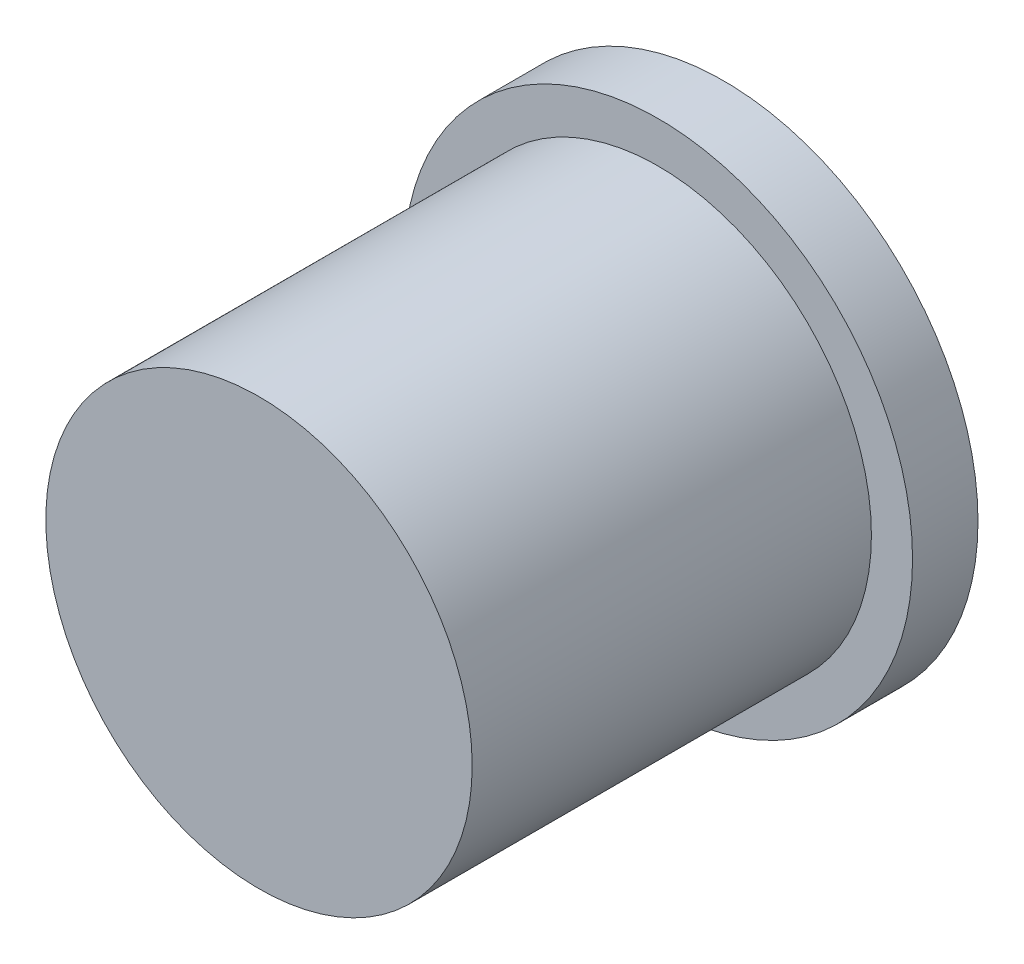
from build123d import *

# Parameters (mm, degrees)
SKETCH1_R           = 6.9088
BOSS_EXTRUDE1_DEPTH = 1.778
SKETCH2_R           = 5.7912
BOSS_EXTRUDE2_DEPTH = 10.8458
SKETCH3_R           = 3.048
CUT_EXTRUDE1_DEPTH  = 10.9982
SKETCH4_R           = 1.27
BOSS_EXTRUDE3_DEPTH = 8.001
DOME1_FACE_RADIUS   = 1.27
DOME1_HEIGHT        = 1.4986


with BuildPart() as part:
    # Sketch1 → Boss-Extrude1 (new body)
    with BuildSketch(Plane.XY):
        Circle(SKETCH1_R)
    extrude(amount=BOSS_EXTRUDE1_DEPTH)

    # Sketch2 → Boss-Extrude2 (add)
    with BuildSketch(Plane.XY.offset(1.778)):
        Circle(SKETCH2_R)
    extrude(amount=BOSS_EXTRUDE2_DEPTH)

    # Sketch3 → Cut-Extrude1 (cut)
    with BuildSketch(Plane(origin=(0, 0, 0), x_dir=(-1, 0, 0), z_dir=(0, 0, -1))):
        with Locations((0, -2.54)):
            Circle(SKETCH3_R)
    extrude(amount=-CUT_EXTRUDE1_DEPTH, mode=Mode.SUBTRACT)

    # Sketch4 → Boss-Extrude3 (add)
    with BuildSketch(Plane(origin=(0, 0, 10.9982), x_dir=(-1, 0, 0), z_dir=(0, 0, -1))):
        with Locations((0, -2.54)):
            Circle(SKETCH4_R)
    extrude(amount=BOSS_EXTRUDE3_DEPTH)

    # Dome1: a dome of height H over a round flat face of radius A is a cap of a sphere of radius (A * A + H * H) / (2 * H)
    dome1_r = (DOME1_FACE_RADIUS * DOME1_FACE_RADIUS + DOME1_HEIGHT * DOME1_HEIGHT) / (2 * DOME1_HEIGHT)
    dome1_base = Plane((0, -2.54, 2.9972), z_dir=(0, 0, -1))
    with Locations(dome1_base.offset(DOME1_HEIGHT - dome1_r)):
        dome1_ball = Sphere(dome1_r, mode=Mode.PRIVATE)
    add(split(dome1_ball, bisect_by=dome1_base, keep=Keep.TOP, mode=Mode.PRIVATE))


solid = part.part
